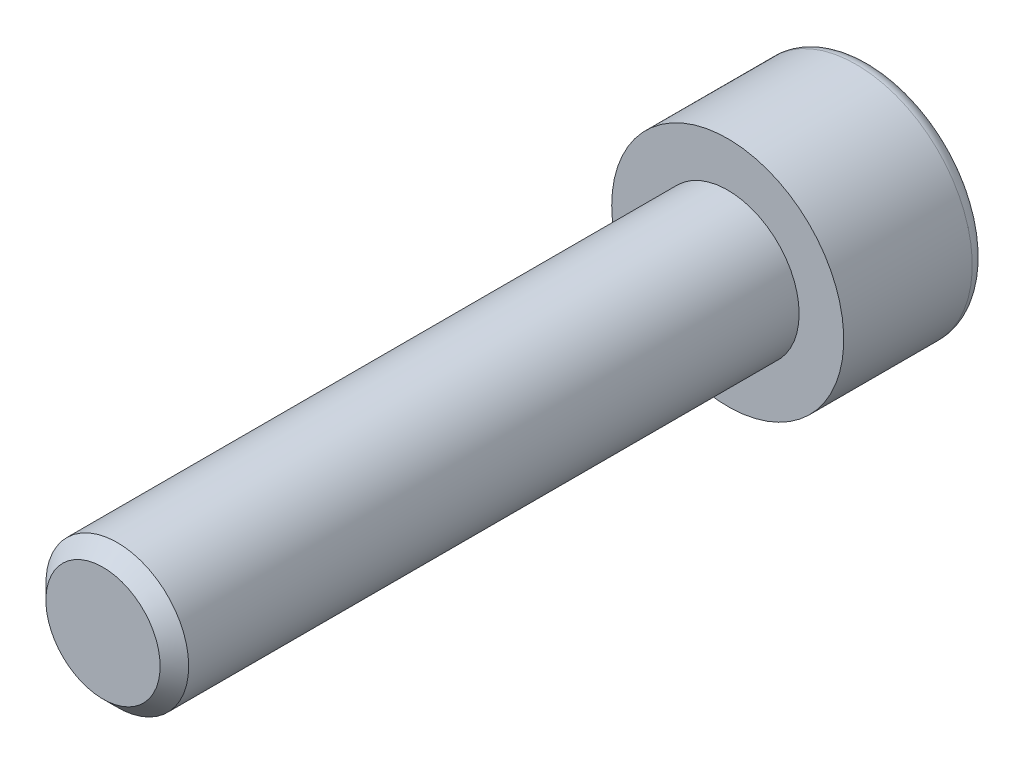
from build123d import *

# Parameters (mm, degrees)
ENLEV_MAT_EXTRU1_DEPTH = 4
ESQUISSE3_W            = 4
ESQUISSE3_H            = 35
CHANFREIN1_SIZE        = 0.8


with BuildPart() as part:
    # Esquisse1 → Base-R_volution (revolve)
    with BuildSketch(Plane(origin=(0, 0, 0), x_dir=(1, 0, 0), z_dir=(0, 1, 0)), mode=Mode.PRIVATE) as base_r_volution_sk:
        with BuildLine():
            Line((0, 0), (6.5, 0))
            Line((6.5, 0), (6.5, 7.2))
            ThreePointArc((6.5, 7.2), (6.265685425, 7.765685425), (5.7, 8))
            Line((5.7, 8), (0, 8))
            Line((0, 8), (0, 0))
        make_face()
    revolve(base_r_volution_sk.sketch.rotate(Axis((0, 0, 0), (0, 0, -1)), 180), axis=Axis((0, 0, 0), (0, 0, -1)))

    # Esquisse2 → enlev-mat-Extru1 (cut)
    with BuildSketch(Plane.XY.offset(-8)):
        Polygon((3, -1.732050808), (3, 1.732050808), (0, 3.464101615), (-3, 1.732050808), (-3, -1.732050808), (0, -3.464101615), align=None)
    extrude(amount=ENLEV_MAT_EXTRU1_DEPTH, mode=Mode.SUBTRACT)

    # Esquisse3 → Boss.-R_vol.1 (revolve)
    with BuildSketch(Plane(origin=(0, 0, 0), x_dir=(1, 0, 0), z_dir=(0, 1, 0))):
        with Locations((2, -17.5)):
            Rectangle(ESQUISSE3_W, ESQUISSE3_H)
    revolve(axis=Axis((0, 0, 0), (0, 0, 1)))

    # Chanfrein1
    chanfrein1_edges = [part.edges().sort_by_distance(p)[0] for p in [
        (-4, 0, 35),
    ]]
    chamfer(chanfrein1_edges, length=CHANFREIN1_SIZE)


solid = part.part
